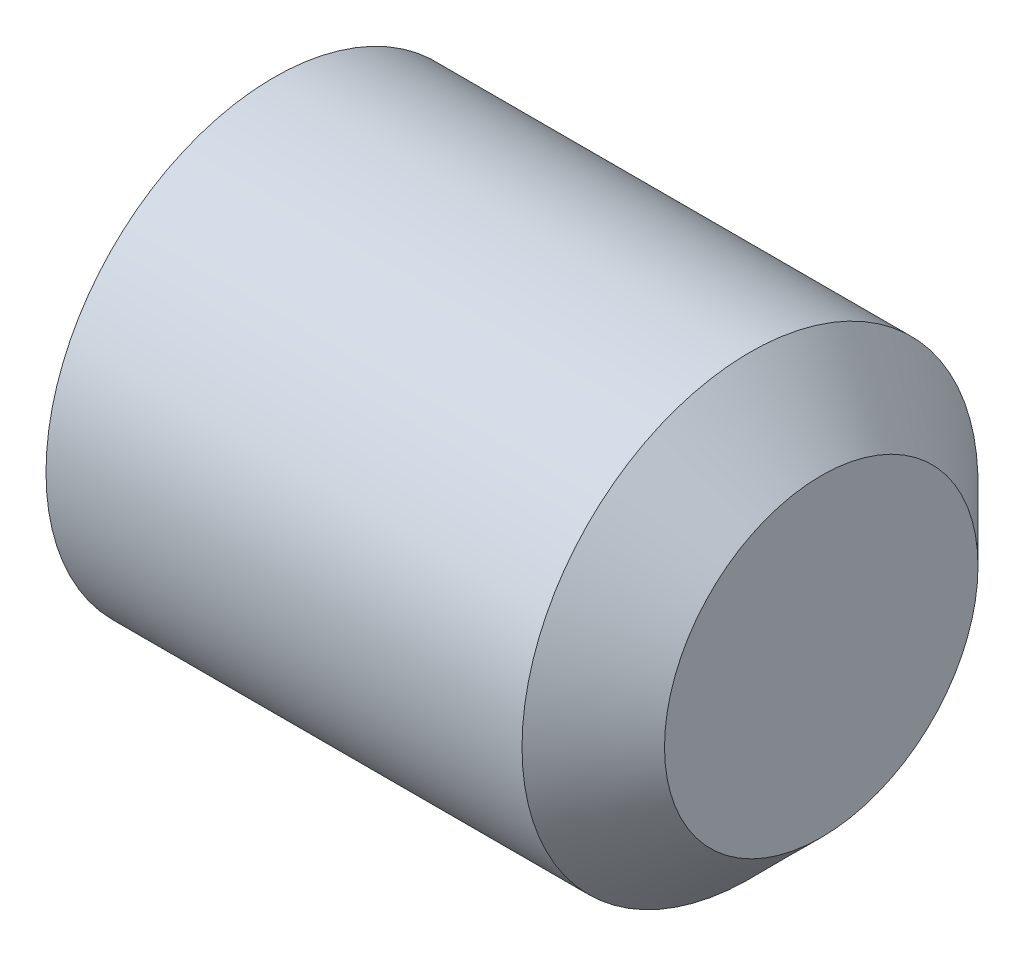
ISO-10303-21;
HEADER;
FILE_DESCRIPTION(('STEP AP214'),'2;1');
FILE_NAME('part.step','',(''),(''),'','','');
FILE_SCHEMA(('AUTOMOTIVE_DESIGN { 1 0 10303 214 1 1 1 1 }'));
ENDSEC;
DATA;
#1=APPLICATION_CONTEXT('core data for automotive mechanical design processes');
#2=APPLICATION_PROTOCOL_DEFINITION('international standard','automotive_design',2000,#1);
#3=PRODUCT_CONTEXT('',#1,'mechanical');
#4=PRODUCT('Part','Part','',(#3));
#5=PRODUCT_RELATED_PRODUCT_CATEGORY('part','',(#4));
#6=PRODUCT_DEFINITION_FORMATION('','',#4);
#7=PRODUCT_DEFINITION_CONTEXT('part definition',#1,'design');
#8=PRODUCT_DEFINITION('design','',#6,#7);
#9=PRODUCT_DEFINITION_SHAPE('','',#8);
#10=(LENGTH_UNIT() NAMED_UNIT(*) SI_UNIT(.MILLI.,.METRE.));
#11=(NAMED_UNIT(*) PLANE_ANGLE_UNIT() SI_UNIT($,.RADIAN.));
#12=(NAMED_UNIT(*) SI_UNIT($,.STERADIAN.) SOLID_ANGLE_UNIT());
#13=UNCERTAINTY_MEASURE_WITH_UNIT(LENGTH_MEASURE(1.E-05),#10,'distance_accuracy_value','');
#14=(GEOMETRIC_REPRESENTATION_CONTEXT(3) GLOBAL_UNCERTAINTY_ASSIGNED_CONTEXT((#13)) GLOBAL_UNIT_ASSIGNED_CONTEXT((#10,
#11,#12)) REPRESENTATION_CONTEXT('',''));
#15=CARTESIAN_POINT('',(0.,0.,0.));
#16=DIRECTION('',(0.,0.,1.));
#17=DIRECTION('',(1.,0.,0.));
#18=AXIS2_PLACEMENT_3D('',#15,#16,#17);
#19=CARTESIAN_POINT('',(0.,0.,0.));
#20=DIRECTION('',(-1.,0.,0.));
#21=DIRECTION('',(0.,0.,1.));
#22=AXIS2_PLACEMENT_3D('',#19,#20,#21);
#23=PLANE('',#22);
#24=CARTESIAN_POINT('',(0.,0.,0.));
#25=DIRECTION('',(-1.,0.,0.));
#26=DIRECTION('',(0.,0.,1.));
#27=AXIS2_PLACEMENT_3D('',#24,#25,#26);
#28=CIRCLE('',#27,3.3095);
#29=CARTESIAN_POINT('',(0.,0.,3.3095));
#30=VERTEX_POINT('',#29);
#31=EDGE_CURVE('E135',#30,#30,#28,.T.);
#32=ORIENTED_EDGE('',*,*,#31,.T.);
#33=EDGE_LOOP('',(#32));
#34=FACE_BOUND('',#33,.T.);
#35=DIRECTION('',(0.,0.,-1.));
#36=VECTOR('',#35,1.);
#37=CARTESIAN_POINT('',(0.,2.,1.15470053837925));
#38=LINE('',#37,#36);
#39=CARTESIAN_POINT('',(0.,2.,1.15470053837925));
#40=VERTEX_POINT('',#39);
#41=CARTESIAN_POINT('',(0.,2.,-1.15470053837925));
#42=VERTEX_POINT('',#41);
#43=EDGE_CURVE('E126',#40,#42,#38,.T.);
#44=ORIENTED_EDGE('',*,*,#43,.F.);
#45=DIRECTION('',(0.,-0.866025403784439,0.5));
#46=VECTOR('',#45,1.);
#47=CARTESIAN_POINT('',(0.,2.,1.15470053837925));
#48=LINE('',#47,#46);
#49=CARTESIAN_POINT('',(0.,0.,2.3094010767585));
#50=VERTEX_POINT('',#49);
#51=EDGE_CURVE('E48',#40,#50,#48,.T.);
#52=ORIENTED_EDGE('',*,*,#51,.T.);
#53=DIRECTION('',(0.,0.866025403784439,0.5));
#54=VECTOR('',#53,1.);
#55=CARTESIAN_POINT('',(0.,-2.,1.15470053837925));
#56=LINE('',#55,#54);
#57=CARTESIAN_POINT('',(0.,-2.,1.15470053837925));
#58=VERTEX_POINT('',#57);
#59=EDGE_CURVE('E117',#58,#50,#56,.T.);
#60=ORIENTED_EDGE('',*,*,#59,.F.);
#61=DIRECTION('',(0.,0.,-1.));
#62=VECTOR('',#61,1.);
#63=CARTESIAN_POINT('',(0.,-2.,1.15470053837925));
#64=LINE('',#63,#62);
#65=CARTESIAN_POINT('',(0.,-2.,-1.15470053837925));
#66=VERTEX_POINT('',#65);
#67=EDGE_CURVE('E120',#58,#66,#64,.T.);
#68=ORIENTED_EDGE('',*,*,#67,.T.);
#69=DIRECTION('',(0.,0.866025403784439,-0.5));
#70=VECTOR('',#69,1.);
#71=CARTESIAN_POINT('',(0.,-2.,-1.15470053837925));
#72=LINE('',#71,#70);
#73=CARTESIAN_POINT('',(0.,0.,-2.30940107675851));
#74=VERTEX_POINT('',#73);
#75=EDGE_CURVE('E123',#66,#74,#72,.T.);
#76=ORIENTED_EDGE('',*,*,#75,.T.);
#77=DIRECTION('',(0.,-0.866025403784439,-0.5));
#78=VECTOR('',#77,1.);
#79=CARTESIAN_POINT('',(0.,2.,-1.15470053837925));
#80=LINE('',#79,#78);
#81=EDGE_CURVE('E106',#42,#74,#80,.T.);
#82=ORIENTED_EDGE('',*,*,#81,.F.);
#83=EDGE_LOOP('',(#44,#52,#60,#68,#76,#82));
#84=FACE_BOUND('',#83,.T.);
#85=ADVANCED_FACE('F33',(#34,#84),#23,.T.);
#86=CARTESIAN_POINT('',(10.,2.75,0.));
#87=DIRECTION('',(1.,0.,0.));
#88=DIRECTION('',(0.,0.,-1.));
#89=AXIS2_PLACEMENT_3D('',#86,#87,#88);
#90=PLANE('',#89);
#91=CARTESIAN_POINT('',(10.,0.,0.));
#92=DIRECTION('',(-1.,0.,0.));
#93=DIRECTION('',(0.,0.,1.));
#94=AXIS2_PLACEMENT_3D('',#91,#92,#93);
#95=CIRCLE('',#94,2.75);
#96=CARTESIAN_POINT('',(10.,0.,2.75));
#97=VERTEX_POINT('',#96);
#98=EDGE_CURVE('E11',#97,#97,#95,.T.);
#99=ORIENTED_EDGE('',*,*,#98,.F.);
#100=EDGE_LOOP('',(#99));
#101=FACE_BOUND('',#100,.T.);
#102=ADVANCED_FACE('F35',(#101),#90,.T.);
#103=CARTESIAN_POINT('',(8.75000000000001,0.,0.));
#104=DIRECTION('',(-1.,0.,0.));
#105=DIRECTION('',(0.,0.,1.));
#106=AXIS2_PLACEMENT_3D('',#103,#104,#105);
#107=CONICAL_SURFACE('',#106,4.,0.785398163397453);
#108=ORIENTED_EDGE('',*,*,#98,.T.);
#109=EDGE_LOOP('',(#108));
#110=FACE_BOUND('',#109,.T.);
#111=CARTESIAN_POINT('',(8.75000000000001,0.,0.));
#112=DIRECTION('',(-1.,0.,0.));
#113=DIRECTION('',(0.,0.,1.));
#114=AXIS2_PLACEMENT_3D('',#111,#112,#113);
#115=CIRCLE('',#114,4.);
#116=CARTESIAN_POINT('',(8.75000000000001,0.,4.));
#117=VERTEX_POINT('',#116);
#118=EDGE_CURVE('E41',#117,#117,#115,.T.);
#119=ORIENTED_EDGE('',*,*,#118,.F.);
#120=EDGE_LOOP('',(#119));
#121=FACE_BOUND('',#120,.T.);
#122=ADVANCED_FACE('F146',(#110,#121),#107,.T.);
#123=CARTESIAN_POINT('',(-12.7,0.,0.));
#124=DIRECTION('',(-1.,0.,0.));
#125=DIRECTION('',(0.,0.,1.));
#126=AXIS2_PLACEMENT_3D('',#123,#124,#125);
#127=CYLINDRICAL_SURFACE('',#126,4.);
#128=ORIENTED_EDGE('',*,*,#118,.T.);
#129=EDGE_LOOP('',(#128));
#130=FACE_BOUND('',#129,.T.);
#131=CARTESIAN_POINT('',(0.398660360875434,0.,0.));
#132=DIRECTION('',(-1.,0.,0.));
#133=DIRECTION('',(0.,0.,1.));
#134=AXIS2_PLACEMENT_3D('',#131,#132,#133);
#135=CIRCLE('',#134,4.);
#136=CARTESIAN_POINT('',(0.398660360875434,0.,4.));
#137=VERTEX_POINT('',#136);
#138=EDGE_CURVE('E138',#137,#137,#135,.T.);
#139=ORIENTED_EDGE('',*,*,#138,.F.);
#140=EDGE_LOOP('',(#139));
#141=FACE_BOUND('',#140,.T.);
#142=ADVANCED_FACE('F143',(#130,#141),#127,.T.);
#143=CARTESIAN_POINT('',(0.,0.,0.));
#144=DIRECTION('',(1.,0.,0.));
#145=DIRECTION('',(0.,0.,-1.));
#146=AXIS2_PLACEMENT_3D('',#143,#144,#145);
#147=CONICAL_SURFACE('',#146,3.3095,1.0471975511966);
#148=ORIENTED_EDGE('',*,*,#138,.T.);
#149=EDGE_LOOP('',(#148));
#150=FACE_BOUND('',#149,.T.);
#151=ORIENTED_EDGE('',*,*,#31,.F.);
#152=EDGE_LOOP('',(#151));
#153=FACE_BOUND('',#152,.T.);
#154=ADVANCED_FACE('F153',(#150,#153),#147,.T.);
#155=CARTESIAN_POINT('',(5.,2.,1.15470053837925));
#156=DIRECTION('',(0.,-0.5,-0.866025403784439));
#157=DIRECTION('',(0.,0.866025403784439,-0.5));
#158=AXIS2_PLACEMENT_3D('',#155,#156,#157);
#159=PLANE('',#158);
#160=ORIENTED_EDGE('',*,*,#51,.F.);
#161=DIRECTION('',(-1.,0.,0.));
#162=VECTOR('',#161,1.);
#163=CARTESIAN_POINT('',(5.,2.,1.15470053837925));
#164=LINE('',#163,#162);
#165=CARTESIAN_POINT('',(5.,2.,1.15470053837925));
#166=VERTEX_POINT('',#165);
#167=EDGE_CURVE('E53',#166,#40,#164,.T.);
#168=ORIENTED_EDGE('',*,*,#167,.F.);
#169=DIRECTION('',(0.,-0.866025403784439,0.5));
#170=VECTOR('',#169,1.);
#171=CARTESIAN_POINT('',(5.,2.,1.15470053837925));
#172=LINE('',#171,#170);
#173=CARTESIAN_POINT('',(5.,0.,2.3094010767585));
#174=VERTEX_POINT('',#173);
#175=EDGE_CURVE('E80',#166,#174,#172,.T.);
#176=ORIENTED_EDGE('',*,*,#175,.T.);
#177=DIRECTION('',(-1.,0.,0.));
#178=VECTOR('',#177,1.);
#179=CARTESIAN_POINT('',(5.,0.,2.3094010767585));
#180=LINE('',#179,#178);
#181=EDGE_CURVE('E133',#174,#50,#180,.T.);
#182=ORIENTED_EDGE('',*,*,#181,.T.);
#183=EDGE_LOOP('',(#160,#168,#176,#182));
#184=FACE_BOUND('',#183,.T.);
#185=ADVANCED_FACE('F164',(#184),#159,.T.);
#186=CARTESIAN_POINT('',(5.,-2.,1.15470053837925));
#187=DIRECTION('',(0.,-0.5,0.866025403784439));
#188=DIRECTION('',(0.,-0.866025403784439,-0.5));
#189=AXIS2_PLACEMENT_3D('',#186,#187,#188);
#190=PLANE('',#189);
#191=ORIENTED_EDGE('',*,*,#59,.T.);
#192=ORIENTED_EDGE('',*,*,#181,.F.);
#193=DIRECTION('',(0.,0.866025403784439,0.5));
#194=VECTOR('',#193,1.);
#195=CARTESIAN_POINT('',(5.,-2.,1.15470053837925));
#196=LINE('',#195,#194);
#197=CARTESIAN_POINT('',(5.,-2.,1.15470053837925));
#198=VERTEX_POINT('',#197);
#199=EDGE_CURVE('E262',#198,#174,#196,.T.);
#200=ORIENTED_EDGE('',*,*,#199,.F.);
#201=DIRECTION('',(-1.,0.,0.));
#202=VECTOR('',#201,1.);
#203=CARTESIAN_POINT('',(5.,-2.,1.15470053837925));
#204=LINE('',#203,#202);
#205=EDGE_CURVE('E131',#198,#58,#204,.T.);
#206=ORIENTED_EDGE('',*,*,#205,.T.);
#207=EDGE_LOOP('',(#191,#192,#200,#206));
#208=FACE_BOUND('',#207,.T.);
#209=ADVANCED_FACE('F171',(#208),#190,.F.);
#210=CARTESIAN_POINT('',(5.,-2.,1.15470053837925));
#211=DIRECTION('',(0.,1.,0.));
#212=DIRECTION('',(0.,0.,1.));
#213=AXIS2_PLACEMENT_3D('',#210,#211,#212);
#214=PLANE('',#213);
#215=ORIENTED_EDGE('',*,*,#67,.F.);
#216=ORIENTED_EDGE('',*,*,#205,.F.);
#217=DIRECTION('',(0.,0.,-1.));
#218=VECTOR('',#217,1.);
#219=CARTESIAN_POINT('',(5.,-2.,1.15470053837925));
#220=LINE('',#219,#218);
#221=CARTESIAN_POINT('',(5.,-2.,-1.15470053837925));
#222=VERTEX_POINT('',#221);
#223=EDGE_CURVE('E101',#198,#222,#220,.T.);
#224=ORIENTED_EDGE('',*,*,#223,.T.);
#225=DIRECTION('',(-1.,0.,0.));
#226=VECTOR('',#225,1.);
#227=CARTESIAN_POINT('',(5.,-2.,-1.15470053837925));
#228=LINE('',#227,#226);
#229=EDGE_CURVE('E96',#222,#66,#228,.T.);
#230=ORIENTED_EDGE('',*,*,#229,.T.);
#231=EDGE_LOOP('',(#215,#216,#224,#230));
#232=FACE_BOUND('',#231,.T.);
#233=ADVANCED_FACE('F178',(#232),#214,.T.);
#234=CARTESIAN_POINT('',(5.,-2.,-1.15470053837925));
#235=DIRECTION('',(0.,0.5,0.866025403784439));
#236=DIRECTION('',(0.,-0.866025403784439,0.5));
#237=AXIS2_PLACEMENT_3D('',#234,#235,#236);
#238=PLANE('',#237);
#239=ORIENTED_EDGE('',*,*,#75,.F.);
#240=ORIENTED_EDGE('',*,*,#229,.F.);
#241=DIRECTION('',(0.,0.866025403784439,-0.5));
#242=VECTOR('',#241,1.);
#243=CARTESIAN_POINT('',(5.,-2.,-1.15470053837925));
#244=LINE('',#243,#242);
#245=CARTESIAN_POINT('',(5.,0.,-2.30940107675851));
#246=VERTEX_POINT('',#245);
#247=EDGE_CURVE('E91',#222,#246,#244,.T.);
#248=ORIENTED_EDGE('',*,*,#247,.T.);
#249=DIRECTION('',(-1.,0.,0.));
#250=VECTOR('',#249,1.);
#251=CARTESIAN_POINT('',(5.,0.,-2.30940107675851));
#252=LINE('',#251,#250);
#253=EDGE_CURVE('E95',#246,#74,#252,.T.);
#254=ORIENTED_EDGE('',*,*,#253,.T.);
#255=EDGE_LOOP('',(#239,#240,#248,#254));
#256=FACE_BOUND('',#255,.T.);
#257=ADVANCED_FACE('F94',(#256),#238,.T.);
#258=CARTESIAN_POINT('',(5.,2.,-1.15470053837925));
#259=DIRECTION('',(0.,0.5,-0.866025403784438));
#260=DIRECTION('',(0.,0.866025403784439,0.5));
#261=AXIS2_PLACEMENT_3D('',#258,#259,#260);
#262=PLANE('',#261);
#263=ORIENTED_EDGE('',*,*,#81,.T.);
#264=ORIENTED_EDGE('',*,*,#253,.F.);
#265=DIRECTION('',(0.,-0.866025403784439,-0.5));
#266=VECTOR('',#265,1.);
#267=CARTESIAN_POINT('',(5.,2.,-1.15470053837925));
#268=LINE('',#267,#266);
#269=CARTESIAN_POINT('',(5.,2.,-1.15470053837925));
#270=VERTEX_POINT('',#269);
#271=EDGE_CURVE('E100',#270,#246,#268,.T.);
#272=ORIENTED_EDGE('',*,*,#271,.F.);
#273=DIRECTION('',(-1.,0.,0.));
#274=VECTOR('',#273,1.);
#275=CARTESIAN_POINT('',(5.,2.,-1.15470053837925));
#276=LINE('',#275,#274);
#277=EDGE_CURVE('E76',#270,#42,#276,.T.);
#278=ORIENTED_EDGE('',*,*,#277,.T.);
#279=EDGE_LOOP('',(#263,#264,#272,#278));
#280=FACE_BOUND('',#279,.T.);
#281=ADVANCED_FACE('F103',(#280),#262,.F.);
#282=CARTESIAN_POINT('',(5.,2.,1.15470053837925));
#283=DIRECTION('',(0.,1.,0.));
#284=DIRECTION('',(0.,0.,1.));
#285=AXIS2_PLACEMENT_3D('',#282,#283,#284);
#286=PLANE('',#285);
#287=ORIENTED_EDGE('',*,*,#43,.T.);
#288=ORIENTED_EDGE('',*,*,#277,.F.);
#289=DIRECTION('',(0.,0.,-1.));
#290=VECTOR('',#289,1.);
#291=CARTESIAN_POINT('',(5.,2.,1.15470053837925));
#292=LINE('',#291,#290);
#293=EDGE_CURVE('E111',#166,#270,#292,.T.);
#294=ORIENTED_EDGE('',*,*,#293,.F.);
#295=ORIENTED_EDGE('',*,*,#167,.T.);
#296=EDGE_LOOP('',(#287,#288,#294,#295));
#297=FACE_BOUND('',#296,.T.);
#298=ADVANCED_FACE('F190',(#297),#286,.F.);
#299=CARTESIAN_POINT('',(5.,2.,1.15470053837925));
#300=DIRECTION('',(1.,0.,0.));
#301=DIRECTION('',(0.,0.,-1.));
#302=AXIS2_PLACEMENT_3D('',#299,#300,#301);
#303=PLANE('',#302);
#304=ORIENTED_EDGE('',*,*,#175,.F.);
#305=ORIENTED_EDGE('',*,*,#293,.T.);
#306=ORIENTED_EDGE('',*,*,#271,.T.);
#307=ORIENTED_EDGE('',*,*,#247,.F.);
#308=ORIENTED_EDGE('',*,*,#223,.F.);
#309=ORIENTED_EDGE('',*,*,#199,.T.);
#310=EDGE_LOOP('',(#304,#305,#306,#307,#308,#309));
#311=FACE_BOUND('',#310,.T.);
#312=ADVANCED_FACE('F109',(#311),#303,.F.);
#313=CLOSED_SHELL('',(#85,#102,#122,#142,#154,#185,#209,#233,#257,#281,#298,#312));
#314=MANIFOLD_SOLID_BREP('B2',#313);
#315=ADVANCED_BREP_SHAPE_REPRESENTATION('',(#18,#314),#14);
#316=SHAPE_DEFINITION_REPRESENTATION(#9,#315);
ENDSEC;
END-ISO-10303-21;
